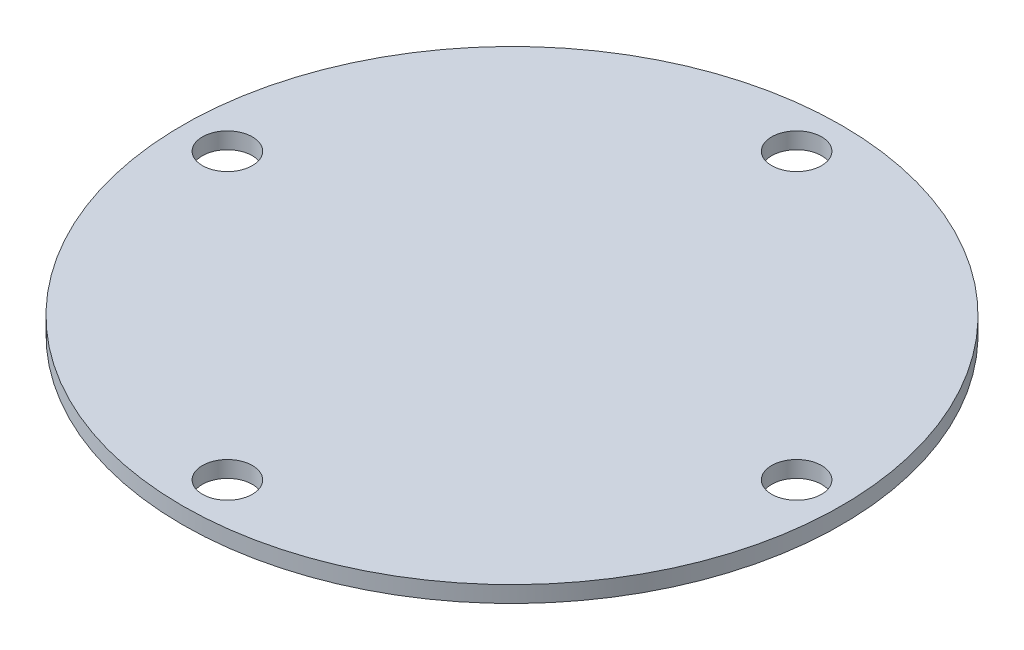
from build123d import *

# Parameters (mm, degrees)
SKETCH1_R           = 33
SKETCH1_R_2         = 2.5
BOSS_EXTRUDE1_DEPTH = 1.64


with BuildPart() as part:
    # Sketch1 → Boss-Extrude1 (new body)
    with BuildSketch(Plane(origin=(0, 0, 0), x_dir=(1, 0, 0), z_dir=(0, 1, 0))):
        with Locations(Location((0, 0, 0), (0, 0, 270))):
            Circle(SKETCH1_R)
        with Locations(Location((0, 28.5, 0), (0, 0, 270))):
            Circle(SKETCH1_R_2, mode=Mode.SUBTRACT)
        with Locations(Location((28.5, 0, 0), (0, 0, 270))):
            Circle(SKETCH1_R_2, mode=Mode.SUBTRACT)
        with Locations(Location((0, -28.5, 0), (0, 0, 270))):
            Circle(SKETCH1_R_2, mode=Mode.SUBTRACT)
        with Locations(Location((-28.5, 0, 0), (0, 0, 270))):
            Circle(SKETCH1_R_2, mode=Mode.SUBTRACT)
    extrude(amount=BOSS_EXTRUDE1_DEPTH)


solid = part.part
